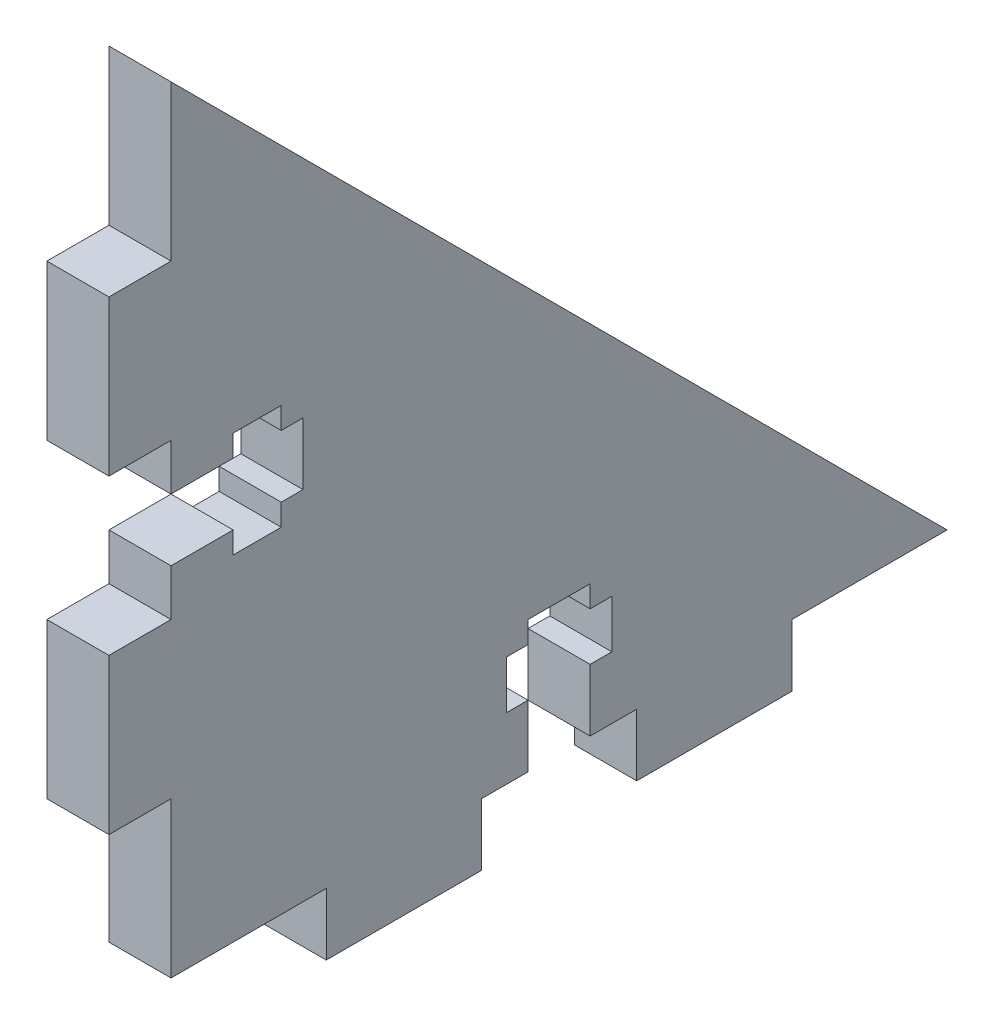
from build123d import *

# Parameters (mm, degrees)
SKETCH1_W           = 4
SKETCH1_H           = 10
SKETCH1_W_2         = 10
SKETCH1_H_2         = 4
BOSS_EXTRUDE1_DEPTH = 4


with BuildPart() as part:
    # Sketch1 → Boss-Extrude1 (new body)
    with BuildSketch(Plane(origin=(0, 0, 0), x_dir=(0, 0, -1), z_dir=(1, 0, 0))):
        Polygon((0, 10), (0, 0), (10, 0), (20, 0), (23, 0), (23, 4), (21.6, 4), (21.6, 7.1), (23, 7.1), (23, 8.5), (27, 8.5), (27, 7.1), (28.4, 7.1), (28.4, 4), (27, 4), (27, 0), (30, 0), (40, 0), (50, 0), (0, 50), (0, 40), (0, 30), (0, 27), (4, 27), (4, 28.4), (7.1, 28.4), (7.1, 27), (8.5, 27), (8.5, 23), (7.1, 23), (7.1, 21.6), (4, 21.6), (4, 23), (0, 23), (0, 20), align=None)
        with Locations((-2, 35)):
            Rectangle(SKETCH1_W, SKETCH1_H)
        with Locations((-2, 15)):
            Rectangle(SKETCH1_W, SKETCH1_H)
        with Locations((15, -2)):
            Rectangle(SKETCH1_W_2, SKETCH1_H_2)
        with Locations((35, -2)):
            Rectangle(SKETCH1_W_2, SKETCH1_H_2)
    extrude(amount=-BOSS_EXTRUDE1_DEPTH)


solid = part.part
